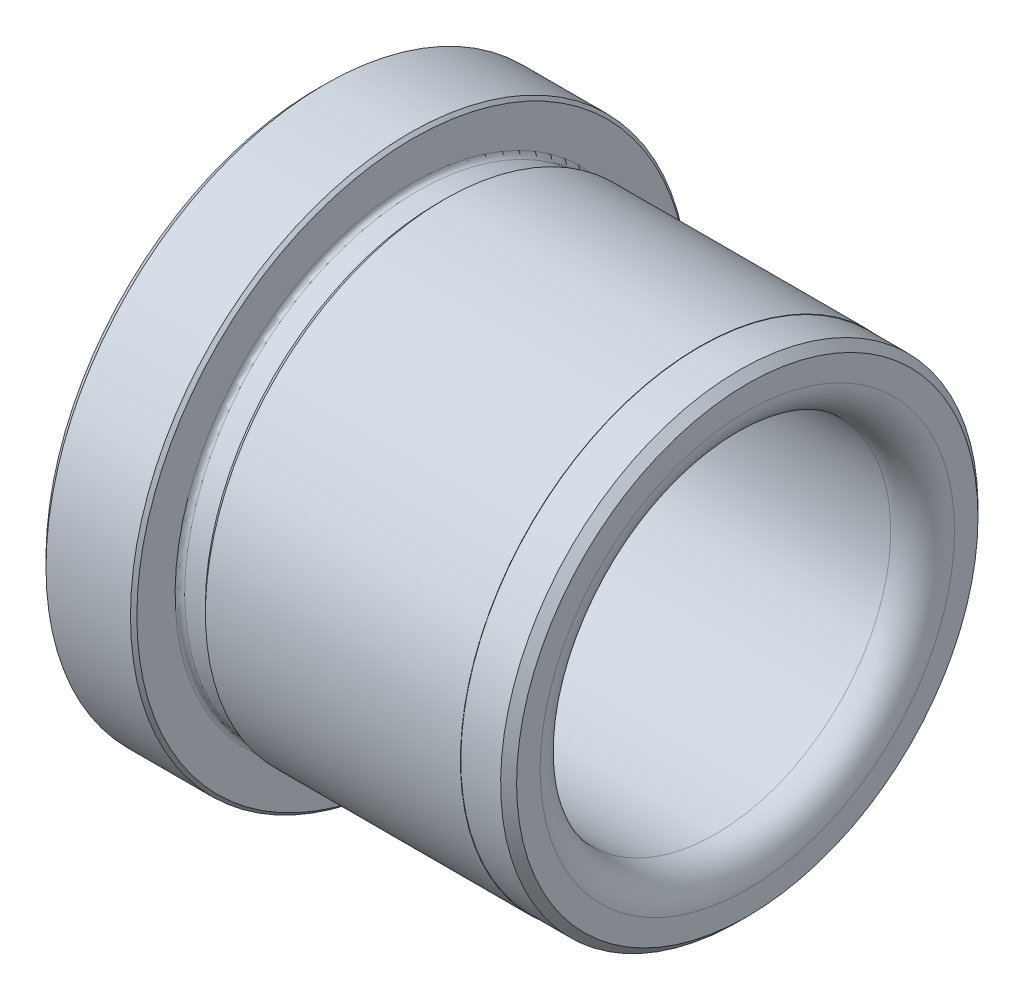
from build123d import *

# Parameters (mm, degrees)
SKETCH2_R      = 11
EXTRUDE1_DEPTH = 76
FILLET2_R      = 2
CHAMFER3_SIZE  = 0.5
CHAMFER4_SIZE  = 0.2


with BuildPart() as part:
    # Sketch1 → Revolve1 (revolve)
    with BuildSketch(Plane.XY):
        with BuildLine():
            Line((13.5, 14.975), (10.5, 14.975))
            Line((10.5, 14.975), (10.5, 15))
            Line((10.5, 15), (-5.5, 15))
            Line((-5.5, 15), (-5.9, 14.6))
            Line((-5.9, 14.6), (-7.2, 14.6))
            ThreePointArc((-7.2, 14.6), (-7.412132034, 14.687867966), (-7.5, 14.9))
            Line((-7.5, 14.9), (-7.5, 17.5))
            Line((-7.5, 17.5), (-13.5, 17.5))
            Line((-13.5, 17.5), (-13.5, 0))
            Line((-13.5, 0), (13.5, 0))
            Line((13.5, 0), (13.5, 14.975))
        make_face()
    revolve(axis=Axis((13.5, 0, 0), (-1, 0, 0)))

    # Sketch2 → Extrude1 (cut)
    with BuildSketch(Plane(origin=(13.5, 0, 0), x_dir=(0, 0, -1), z_dir=(1, 0, 0))):
        with Locations(Location((0, 0, 0), (0, 0, 90))):
            Circle(SKETCH2_R)
    extrude(amount=-EXTRUDE1_DEPTH, mode=Mode.SUBTRACT)

    # Fillet2
    fillet2_edges = [part.edges().sort_by_distance(p)[0] for p in [
        (13.5, -11, 0),
    ]]
    fillet(fillet2_edges, radius=FILLET2_R)

    # Chamfer3
    chamfer3_edges = [part.edges().sort_by_distance(p)[0] for p in [
        (-13.5, -11, 0),
        (-13.5, -17.5, 0),
        (13.5, -14.975, 0),
    ]]
    chamfer(chamfer3_edges, length=CHAMFER3_SIZE)

    # Chamfer4
    chamfer4_edges = [part.edges().sort_by_distance(p)[0] for p in [
        (-7.5, -17.5, 0),
    ]]
    chamfer(chamfer4_edges, length=CHAMFER4_SIZE)


solid = part.part
